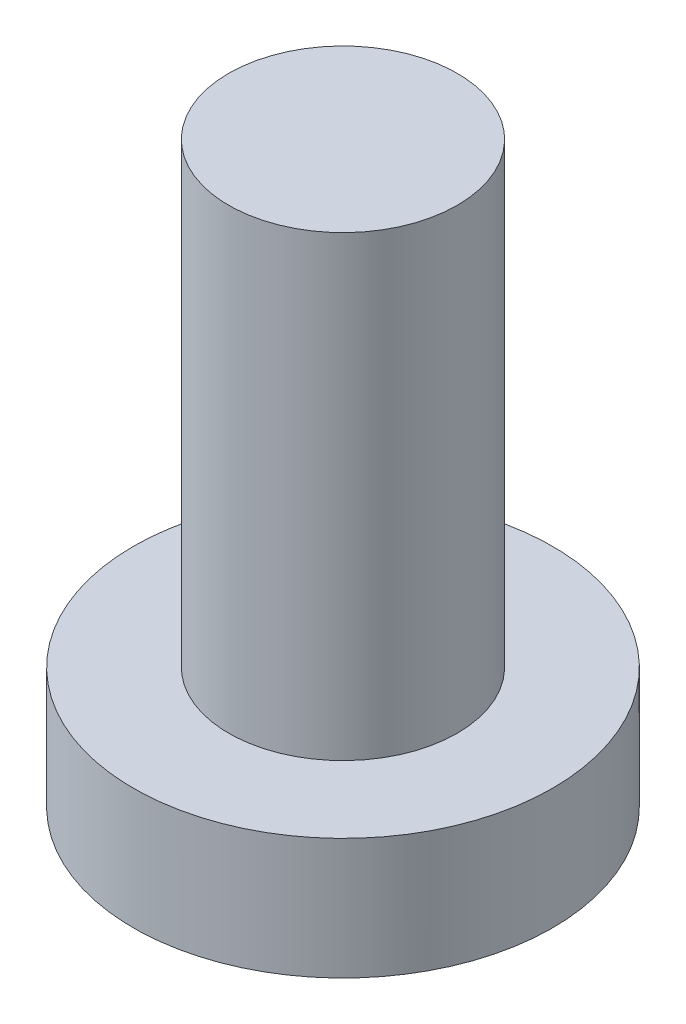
ISO-10303-21;
HEADER;
FILE_DESCRIPTION(('STEP AP214'),'2;1');
FILE_NAME('part.step','',(''),(''),'','','');
FILE_SCHEMA(('AUTOMOTIVE_DESIGN { 1 0 10303 214 1 1 1 1 }'));
ENDSEC;
DATA;
#1=APPLICATION_CONTEXT('core data for automotive mechanical design processes');
#2=APPLICATION_PROTOCOL_DEFINITION('international standard','automotive_design',2000,#1);
#3=PRODUCT_CONTEXT('',#1,'mechanical');
#4=PRODUCT('Part','Part','',(#3));
#5=PRODUCT_RELATED_PRODUCT_CATEGORY('part','',(#4));
#6=PRODUCT_DEFINITION_FORMATION('','',#4);
#7=PRODUCT_DEFINITION_CONTEXT('part definition',#1,'design');
#8=PRODUCT_DEFINITION('design','',#6,#7);
#9=PRODUCT_DEFINITION_SHAPE('','',#8);
#10=(LENGTH_UNIT() NAMED_UNIT(*) SI_UNIT(.MILLI.,.METRE.));
#11=(NAMED_UNIT(*) PLANE_ANGLE_UNIT() SI_UNIT($,.RADIAN.));
#12=(NAMED_UNIT(*) SI_UNIT($,.STERADIAN.) SOLID_ANGLE_UNIT());
#13=UNCERTAINTY_MEASURE_WITH_UNIT(LENGTH_MEASURE(1.E-05),#10,'distance_accuracy_value','');
#14=(GEOMETRIC_REPRESENTATION_CONTEXT(3) GLOBAL_UNCERTAINTY_ASSIGNED_CONTEXT((#13)) GLOBAL_UNIT_ASSIGNED_CONTEXT((#10,
#11,#12)) REPRESENTATION_CONTEXT('',''));
#15=CARTESIAN_POINT('',(0.,0.,0.));
#16=DIRECTION('',(0.,0.,1.));
#17=DIRECTION('',(1.,0.,0.));
#18=AXIS2_PLACEMENT_3D('',#15,#16,#17);
#19=CARTESIAN_POINT('',(9.04741823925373,-41.7373986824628,541.166482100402));
#20=DIRECTION('',(-4.19331020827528E-13,-1.,2.54760156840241E-13));
#21=DIRECTION('',(1.,-4.19331020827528E-13,0.));
#22=AXIS2_PLACEMENT_3D('',#19,#20,#21);
#23=CYLINDRICAL_SURFACE('',#22,0.300000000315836);
#24=DIRECTION('',(1.1719418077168E-13,1.,0.));
#25=VECTOR('',#24,1.);
#26=CARTESIAN_POINT('',(9.28960542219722,-41.7382555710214,541.343528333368));
#27=LINE('',#26,#25);
#28=CARTESIAN_POINT('',(9.2896054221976,-43.2695144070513,541.343528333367));
#29=VERTEX_POINT('',#28);
#30=CARTESIAN_POINT('',(9.28960541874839,-41.878551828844,541.343528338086));
#31=VERTEX_POINT('',#30);
#32=EDGE_CURVE('E227',#29,#31,#27,.T.);
#33=ORIENTED_EDGE('',*,*,#32,.F.);
#34=CARTESIAN_POINT('',(9.2896054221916,-43.2695144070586,541.343528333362));
#35=CARTESIAN_POINT('',(9.30118468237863,-43.2713455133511,541.327738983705));
#36=CARTESIAN_POINT('',(9.31118085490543,-43.2729932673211,541.310770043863));
#37=CARTESIAN_POINT('',(9.32768936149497,-43.2758660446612,541.275230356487));
#38=CARTESIAN_POINT('',(9.33420990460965,-43.2770920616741,541.256663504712));
#39=CARTESIAN_POINT('',(9.34282782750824,-43.2789296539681,541.221384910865));
#40=CARTESIAN_POINT('',(9.34543237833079,-43.2796048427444,541.204798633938));
#41=CARTESIAN_POINT('',(9.34784293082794,-43.2805946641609,541.171420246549));
#42=CARTESIAN_POINT('',(9.34765050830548,-43.2809094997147,541.154628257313));
#43=CARTESIAN_POINT('',(9.34446949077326,-43.281169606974,541.121306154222));
#44=CARTESIAN_POINT('',(9.34148045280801,-43.2811148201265,541.104776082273));
#45=CARTESIAN_POINT('',(9.33278989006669,-43.2806371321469,541.072443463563));
#46=CARTESIAN_POINT('',(9.32708734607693,-43.2802140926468,541.056641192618));
#47=CARTESIAN_POINT('',(9.31314056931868,-43.2790125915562,541.026226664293));
#48=CARTESIAN_POINT('',(9.30489741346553,-43.2782342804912,541.011613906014));
#49=CARTESIAN_POINT('',(9.28610932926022,-43.276344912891,540.983985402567));
#50=CARTESIAN_POINT('',(9.27556643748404,-43.2752341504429,540.970968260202));
#51=CARTESIAN_POINT('',(9.25795338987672,-43.2733098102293,540.952583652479));
#52=CARTESIAN_POINT('',(9.25159531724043,-43.272603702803,540.946507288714));
#53=CARTESIAN_POINT('',(9.23838819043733,-43.2711151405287,540.934949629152));
#54=CARTESIAN_POINT('',(9.23154004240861,-43.2703328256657,540.929467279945));
#55=CARTESIAN_POINT('',(9.22446448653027,-43.2695144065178,540.924294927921));
#56=B_SPLINE_CURVE_WITH_KNOTS('',3,(#34,#35,#36,#37,#38,#39,#40,#41,#42,#43,#44,#45,#46,#47,#48,
#49,#50,#51,#52,#53,#54,#55),.UNSPECIFIED.,.F.,.F.,(4,2,2,2,2,2,2,2,2,2,4),(0.,
0.0589049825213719,0.11767021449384,0.167846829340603,0.217995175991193,0.268151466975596,
0.318326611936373,0.368480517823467,0.418590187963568,0.445029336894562,0.471420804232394),.UNSPECIFIED.);
#57=CARTESIAN_POINT('',(9.22446448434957,-43.2695144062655,540.924294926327));
#58=VERTEX_POINT('',#57);
#59=EDGE_CURVE('E38',#29,#58,#56,.T.);
#60=ORIENTED_EDGE('',*,*,#59,.T.);
#61=DIRECTION('',(2.63164344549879E-13,1.,-3.59990862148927E-13));
#62=VECTOR('',#61,1.);
#63=CARTESIAN_POINT('',(9.22446448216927,-41.7382555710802,540.924294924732));
#64=LINE('',#63,#62);
#65=CARTESIAN_POINT('',(9.22446448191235,-41.8785518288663,540.924294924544));
#66=VERTEX_POINT('',#65);
#67=EDGE_CURVE('E233',#66,#58,#64,.F.);
#68=ORIENTED_EDGE('',*,*,#67,.F.);
#69=CARTESIAN_POINT('',(9.04741823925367,-41.8785518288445,541.166482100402));
#70=DIRECTION('',(-4.19331020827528E-13,-1.,2.54760156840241E-13));
#71=DIRECTION('',(1.,-4.19331020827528E-13,0.));
#72=AXIS2_PLACEMENT_3D('',#69,#70,#71);
#73=CIRCLE('',#72,0.300000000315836);
#74=EDGE_CURVE('E319',#31,#66,#73,.F.);
#75=ORIENTED_EDGE('',*,*,#74,.F.);
#76=EDGE_LOOP('',(#33,#60,#68,#75));
#77=FACE_BOUND('',#76,.T.);
#78=ADVANCED_FACE('F34',(#77),#23,.T.);
#79=CARTESIAN_POINT('',(10.0020017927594,-41.5701304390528,541.983626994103));
#80=DIRECTION('',(0.511088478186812,-0.499999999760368,-0.699134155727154));
#81=DIRECTION('',(-0.8072905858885,0.,-0.590154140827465));
#82=AXIS2_PLACEMENT_3D('',#79,#80,#81);
#83=PLANE('',#82);
#84=DIRECTION('',(0.295077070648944,0.866025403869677,-0.403645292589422));
#85=VECTOR('',#84,1.);
#86=CARTESIAN_POINT('',(9.27443668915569,-43.1063439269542,542.550408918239));
#87=LINE('',#86,#85);
#88=CARTESIAN_POINT('',(9.27443668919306,-43.1063439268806,542.550408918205));
#89=VERTEX_POINT('',#88);
#90=CARTESIAN_POINT('',(9.69277695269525,-41.8785518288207,541.978147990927));
#91=VERTEX_POINT('',#90);
#92=EDGE_CURVE('E212',#89,#91,#87,.T.);
#93=ORIENTED_EDGE('',*,*,#92,.F.);
#94=CARTESIAN_POINT('',(10.9699896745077,-37.3007795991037,539.637942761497));
#95=DIRECTION('',(0.511088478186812,-0.499999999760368,-0.699134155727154));
#96=DIRECTION('',(-0.8072905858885,0.,-0.590154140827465));
#97=AXIS2_PLACEMENT_3D('',#94,#95,#96);
#98=CIRCLE('',#97,6.71281879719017);
#99=CARTESIAN_POINT('',(8.70933327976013,-43.1063439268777,542.137301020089));
#100=VERTEX_POINT('',#99);
#101=EDGE_CURVE('E457',#89,#100,#98,.T.);
#102=ORIENTED_EDGE('',*,*,#101,.T.);
#103=DIRECTION('',(-0.295077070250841,-0.866025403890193,0.403645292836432));
#104=VECTOR('',#103,1.);
#105=CARTESIAN_POINT('',(9.12767354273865,-41.8785518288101,541.565040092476));
#106=LINE('',#105,#104);
#107=CARTESIAN_POINT('',(9.12767354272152,-41.8785518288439,541.565040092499));
#108=VERTEX_POINT('',#107);
#109=EDGE_CURVE('E221',#108,#100,#106,.T.);
#110=ORIENTED_EDGE('',*,*,#109,.F.);
#111=DIRECTION('',(-0.807290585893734,0.,-0.590154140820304));
#112=VECTOR('',#111,1.);
#113=CARTESIAN_POINT('',(9.69277695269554,-41.8785518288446,541.978147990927));
#114=LINE('',#113,#112);
#115=EDGE_CURVE('E164',#91,#108,#114,.T.);
#116=ORIENTED_EDGE('',*,*,#115,.F.);
#117=EDGE_LOOP('',(#93,#102,#110,#116));
#118=FACE_BOUND('',#117,.T.);
#119=ADVANCED_FACE('F271',(#118),#83,.T.);
#120=CARTESIAN_POINT('',(10.0968960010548,-41.7370957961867,541.933682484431));
#121=DIRECTION('',(-7.56376610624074E-13,-1.,1.72474725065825E-13));
#122=DIRECTION('',(1.,-7.56376610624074E-13,0.));
#123=AXIS2_PLACEMENT_3D('',#120,#121,#122);
#124=CYLINDRICAL_SURFACE('',#123,0.299999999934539);
#125=DIRECTION('',(2.49468838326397E-13,1.,-3.41256344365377E-13));
#126=VECTOR('',#125,1.);
#127=CARTESIAN_POINT('',(10.2739422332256,-41.7382555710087,541.691495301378));
#128=LINE('',#127,#126);
#129=CARTESIAN_POINT('',(10.2739422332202,-43.2695144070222,541.691495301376));
#130=VERTEX_POINT('',#129);
#131=CARTESIAN_POINT('',(10.2739422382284,-41.8785518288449,541.691495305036));
#132=VERTEX_POINT('',#131);
#133=EDGE_CURVE('E209',#130,#132,#128,.T.);
#134=ORIENTED_EDGE('',*,*,#133,.F.);
#135=CARTESIAN_POINT('',(10.2739422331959,-43.2695144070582,541.691495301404));
#136=CARTESIAN_POINT('',(10.2604121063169,-43.2710817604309,541.681586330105));
#137=CARTESIAN_POINT('',(10.2460269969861,-43.2725156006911,541.6728294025));
#138=CARTESIAN_POINT('',(10.2159870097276,-43.2750808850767,541.657826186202));
#139=CARTESIAN_POINT('',(10.2003328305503,-43.2762124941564,541.651578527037));
#140=CARTESIAN_POINT('',(10.1681683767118,-43.2781403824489,541.641785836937));
#141=CARTESIAN_POINT('',(10.1516575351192,-43.2789364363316,541.638242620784));
#142=CARTESIAN_POINT('',(10.1182668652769,-43.2801689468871,541.633972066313));
#143=CARTESIAN_POINT('',(10.1013871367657,-43.2806054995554,541.633243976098));
#144=CARTESIAN_POINT('',(10.0678182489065,-43.281105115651,541.634624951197));
#145=CARTESIAN_POINT('',(10.0511285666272,-43.2811699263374,541.636720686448));
#146=CARTESIAN_POINT('',(10.0183323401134,-43.2809288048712,541.64366746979));
#147=CARTESIAN_POINT('',(10.002225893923,-43.2806228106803,541.648518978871));
#148=CARTESIAN_POINT('',(9.97108905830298,-43.2796500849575,541.660822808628));
#149=CARTESIAN_POINT('',(9.95605663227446,-43.2789840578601,541.66827004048));
#150=CARTESIAN_POINT('',(9.92745701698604,-43.2773110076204,541.685551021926));
#151=CARTESIAN_POINT('',(9.91388916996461,-43.276304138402,541.69538369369));
#152=CARTESIAN_POINT('',(9.89254531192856,-43.2743425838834,541.713744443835));
#153=CARTESIAN_POINT('',(9.88428237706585,-43.273469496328,541.721723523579));
#154=CARTESIAN_POINT('',(9.86873947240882,-43.2715894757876,541.738552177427));
#155=CARTESIAN_POINT('',(9.86145811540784,-43.2705827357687,541.747400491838));
#156=CARTESIAN_POINT('',(9.85470882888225,-43.26951440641,541.756636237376));
#157=B_SPLINE_CURVE_WITH_KNOTS('',3,(#135,#136,#137,#138,#139,#140,#141,#142,#143,#144,#145,
#146,#147,#148,#149,#150,#151,#152,#153,#154,#155,#156),.UNSPECIFIED.,.F.,.F.,(4,2,2,2,2,2,2,2,
2,2,4),(0.,0.0504676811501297,0.100907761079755,0.15138165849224,0.201842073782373,
0.252065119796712,0.302296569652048,0.352430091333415,0.402541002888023,0.437028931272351,
0.471467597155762),.UNSPECIFIED.);
#158=CARTESIAN_POINT('',(9.85470882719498,-43.269514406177,541.75663623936));
#159=VERTEX_POINT('',#158);
#160=EDGE_CURVE('E280',#130,#159,#157,.T.);
#161=ORIENTED_EDGE('',*,*,#160,.T.);
#162=DIRECTION('',(1.03653342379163E-13,1.,0.));
#163=VECTOR('',#162,1.);
#164=CARTESIAN_POINT('',(9.85470882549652,-41.7382555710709,541.75663624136));
#165=LINE('',#164,#163);
#166=CARTESIAN_POINT('',(9.85470882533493,-41.8785518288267,541.756636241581));
#167=VERTEX_POINT('',#166);
#168=EDGE_CURVE('E215',#167,#159,#165,.F.);
#169=ORIENTED_EDGE('',*,*,#168,.F.);
#170=CARTESIAN_POINT('',(10.0968960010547,-41.8785518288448,541.933682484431));
#171=DIRECTION('',(-7.56376610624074E-13,-1.,1.72474725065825E-13));
#172=DIRECTION('',(1.,-7.56376610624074E-13,0.));
#173=AXIS2_PLACEMENT_3D('',#170,#171,#172);
#174=CIRCLE('',#173,0.299999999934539);
#175=EDGE_CURVE('E151',#132,#167,#174,.F.);
#176=ORIENTED_EDGE('',*,*,#175,.F.);
#177=EDGE_LOOP('',(#134,#161,#169,#176));
#178=FACE_BOUND('',#177,.T.);
#179=ADVANCED_FACE('F270',(#178),#124,.T.);
#180=CARTESIAN_POINT('',(10.9143176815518,-41.5707242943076,540.9793012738));
#181=DIRECTION('',(-0.699134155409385,-0.500000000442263,-0.511088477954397));
#182=DIRECTION('',(-0.590154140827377,0.,0.807290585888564));
#183=AXIS2_PLACEMENT_3D('',#180,#181,#182);
#184=PLANE('',#183);
#185=CARTESIAN_POINT('',(11.277954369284,-43.114251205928,541.991909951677));
#186=CARTESIAN_POINT('',(11.1746071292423,-43.1142511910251,542.133281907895));
#187=CARTESIAN_POINT('',(11.0677149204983,-43.1063439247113,542.271767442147));
#188=B_SPLINE_CURVE_WITH_KNOTS('',2,(#185,#186,#187),.UNSPECIFIED.,.F.,.F.,(3,3),(0.,1.),.UNSPECIFIED.);
#189=CARTESIAN_POINT('',(11.2779543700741,-43.1142512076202,541.991909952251));
#190=VERTEX_POINT('',#189);
#191=CARTESIAN_POINT('',(11.0677149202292,-43.106343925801,542.271767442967));
#192=VERTEX_POINT('',#191);
#193=EDGE_CURVE('E274',#190,#192,#188,.T.);
#194=ORIENTED_EDGE('',*,*,#193,.T.);
#195=DIRECTION('',(0.40364529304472,-0.866025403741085,0.295077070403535));
#196=VECTOR('',#195,1.);
#197=CARTESIAN_POINT('',(10.4954539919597,-41.8785518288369,541.853427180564));
#198=LINE('',#197,#196);
#199=CARTESIAN_POINT('',(10.495453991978,-41.878551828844,541.853427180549));
#200=VERTEX_POINT('',#199);
#201=EDGE_CURVE('E179',#200,#192,#198,.T.);
#202=ORIENTED_EDGE('',*,*,#201,.F.);
#203=DIRECTION('',(-0.590154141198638,0.,0.807290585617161));
#204=VECTOR('',#203,1.);
#205=CARTESIAN_POINT('',(10.9085618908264,-41.8785518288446,541.288323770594));
#206=LINE('',#205,#204);
#207=CARTESIAN_POINT('',(10.9085618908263,-41.878551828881,541.288323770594));
#208=VERTEX_POINT('',#207);
#209=EDGE_CURVE('E171',#208,#200,#206,.T.);
#210=ORIENTED_EDGE('',*,*,#209,.F.);
#211=DIRECTION('',(-0.403645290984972,0.866025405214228,-0.295077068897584));
#212=VECTOR('',#211,1.);
#213=CARTESIAN_POINT('',(11.4808228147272,-43.1063439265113,541.70666403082));
#214=LINE('',#213,#212);
#215=CARTESIAN_POINT('',(11.4808228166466,-43.1063439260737,541.706664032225));
#216=VERTEX_POINT('',#215);
#217=EDGE_CURVE('E176',#216,#208,#214,.T.);
#218=ORIENTED_EDGE('',*,*,#217,.F.);
#219=CARTESIAN_POINT('',(11.4808228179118,-43.1063439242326,541.706664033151));
#220=CARTESIAN_POINT('',(11.3813015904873,-43.1142511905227,541.850537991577));
#221=CARTESIAN_POINT('',(11.277954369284,-43.114251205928,541.991909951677));
#222=B_SPLINE_CURVE_WITH_KNOTS('',2,(#219,#220,#221),.UNSPECIFIED.,.F.,.F.,(3,3),(0.,1.),.UNSPECIFIED.);
#223=EDGE_CURVE('E277',#216,#190,#222,.T.);
#224=ORIENTED_EDGE('',*,*,#223,.T.);
#225=EDGE_LOOP('',(#194,#202,#210,#218,#224));
#226=FACE_BOUND('',#225,.T.);
#227=ADVANCED_FACE('F173',(#226),#184,.T.);
#228=CARTESIAN_POINT('',(10.8640963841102,-41.7370957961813,540.884204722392));
#229=DIRECTION('',(-3.9137561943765E-13,-1.,2.37776146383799E-13));
#230=DIRECTION('',(1.,-3.9137561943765E-13,0.));
#231=AXIS2_PLACEMENT_3D('',#228,#229,#230);
#232=CYLINDRICAL_SURFACE('',#231,0.300000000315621);
#233=DIRECTION('',(1.0365334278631E-13,1.,0.));
#234=VECTOR('',#233,1.);
#235=CARTESIAN_POINT('',(10.6219092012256,-41.7382555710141,540.707158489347));
#236=LINE('',#235,#234);
#237=CARTESIAN_POINT('',(10.621909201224,-43.2695144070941,540.707158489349));
#238=VERTEX_POINT('',#237);
#239=CARTESIAN_POINT('',(10.6219092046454,-41.8785518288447,540.707158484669));
#240=VERTEX_POINT('',#239);
#241=EDGE_CURVE('E195',#238,#240,#236,.T.);
#242=ORIENTED_EDGE('',*,*,#241,.F.);
#243=CARTESIAN_POINT('',(10.6219092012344,-43.2695144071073,540.707158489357));
#244=CARTESIAN_POINT('',(10.6120002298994,-43.271081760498,540.720688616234));
#245=CARTESIAN_POINT('',(10.6032433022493,-43.2725156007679,540.735073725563));
#246=CARTESIAN_POINT('',(10.5882400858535,-43.2750808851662,540.765113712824));
#247=CARTESIAN_POINT('',(10.5819924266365,-43.2762124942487,540.780767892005));
#248=CARTESIAN_POINT('',(10.5721997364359,-43.2781403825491,540.812932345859));
#249=CARTESIAN_POINT('',(10.568656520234,-43.278936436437,540.829443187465));
#250=CARTESIAN_POINT('',(10.5643859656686,-43.2801689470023,540.86283385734));
#251=CARTESIAN_POINT('',(10.5636578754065,-43.2806054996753,540.879713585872));
#252=CARTESIAN_POINT('',(10.5650388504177,-43.2811051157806,540.913282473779));
#253=CARTESIAN_POINT('',(10.5671345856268,-43.2811699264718,540.929972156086));
#254=CARTESIAN_POINT('',(10.5740813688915,-43.2809288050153,540.962768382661));
#255=CARTESIAN_POINT('',(10.5789328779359,-43.2806228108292,540.978874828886));
#256=CARTESIAN_POINT('',(10.5912367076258,-43.2796500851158,541.010011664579));
#257=CARTESIAN_POINT('',(10.5986839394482,-43.278984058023,541.025044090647));
#258=CARTESIAN_POINT('',(10.6159649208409,-43.2773110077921,541.053643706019));
#259=CARTESIAN_POINT('',(10.6257975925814,-43.276304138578,541.067211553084));
#260=CARTESIAN_POINT('',(10.6441583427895,-43.2743425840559,541.088555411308));
#261=CARTESIAN_POINT('',(10.652137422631,-43.273469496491,541.096818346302));
#262=CARTESIAN_POINT('',(10.6689660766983,-43.2715894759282,541.112361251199));
#263=CARTESIAN_POINT('',(10.6778143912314,-43.2705827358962,541.119642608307));
#264=CARTESIAN_POINT('',(10.6870501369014,-43.269514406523,541.126391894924));
#265=B_SPLINE_CURVE_WITH_KNOTS('',3,(#243,#244,#245,#246,#247,#248,#249,#250,#251,#252,#253,
#254,#255,#256,#257,#258,#259,#260,#261,#262,#263,#264),.UNSPECIFIED.,.F.,.F.,(4,2,2,2,2,2,2,2,
2,2,4),(0.,0.0504676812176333,0.100907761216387,0.151381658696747,0.201842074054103,
0.252065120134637,0.302296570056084,0.352430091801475,0.40254100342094,0.437028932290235,
0.47146759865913),.UNSPECIFIED.);
#266=CARTESIAN_POINT('',(10.6870501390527,-43.2695144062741,541.126391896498));
#267=VERTEX_POINT('',#266);
#268=EDGE_CURVE('E340',#238,#267,#265,.T.);
#269=ORIENTED_EDGE('',*,*,#268,.T.);
#270=DIRECTION('',(2.63164344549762E-13,1.,-3.59990862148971E-13));
#271=VECTOR('',#270,1.);
#272=CARTESIAN_POINT('',(10.687050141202,-41.7382555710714,541.126391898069));
#273=LINE('',#272,#271);
#274=CARTESIAN_POINT('',(10.687050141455,-41.8785518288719,541.126391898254));
#275=VERTEX_POINT('',#274);
#276=EDGE_CURVE('E190',#275,#267,#273,.F.);
#277=ORIENTED_EDGE('',*,*,#276,.F.);
#278=CARTESIAN_POINT('',(10.8640963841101,-41.8785518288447,540.884204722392));
#279=DIRECTION('',(-3.9137561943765E-13,-1.,2.37776146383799E-13));
#280=DIRECTION('',(1.,-3.9137561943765E-13,0.));
#281=AXIS2_PLACEMENT_3D('',#278,#279,#280);
#282=CIRCLE('',#281,0.300000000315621);
#283=EDGE_CURVE('E186',#240,#275,#282,.F.);
#284=ORIENTED_EDGE('',*,*,#283,.F.);
#285=EDGE_LOOP('',(#242,#269,#277,#284));
#286=FACE_BOUND('',#285,.T.);
#287=ADVANCED_FACE('F265',(#286),#232,.T.);
#288=CARTESIAN_POINT('',(11.5154502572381,-43.4266343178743,539.913332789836));
#289=DIRECTION('',(-0.51108847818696,-0.499999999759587,0.699134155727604));
#290=DIRECTION('',(0.807290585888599,0.,0.590154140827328));
#291=AXIS2_PLACEMENT_3D('',#288,#289,#290);
#292=PLANE('',#291);
#293=DIRECTION('',(-0.295077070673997,0.866025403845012,0.403645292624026));
#294=VECTOR('',#293,1.);
#295=CARTESIAN_POINT('',(10.6370779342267,-43.1063439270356,539.50027790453));
#296=LINE('',#295,#294);
#297=CARTESIAN_POINT('',(10.6370779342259,-43.1063439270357,539.50027790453));
#298=VERTEX_POINT('',#297);
#299=CARTESIAN_POINT('',(10.2187376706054,-41.8785518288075,540.072538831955));
#300=VERTEX_POINT('',#299);
#301=EDGE_CURVE('E408',#298,#300,#296,.T.);
#302=ORIENTED_EDGE('',*,*,#301,.F.);
#303=CARTESIAN_POINT('',(8.94152494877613,-37.3007795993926,542.412744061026));
#304=DIRECTION('',(-0.51108847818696,-0.499999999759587,0.699134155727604));
#305=DIRECTION('',(0.807290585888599,0.,0.590154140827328));
#306=AXIS2_PLACEMENT_3D('',#303,#304,#305);
#307=CIRCLE('',#306,6.71281879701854);
#308=CARTESIAN_POINT('',(11.2021813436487,-43.1063439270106,539.913385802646));
#309=VERTEX_POINT('',#308);
#310=EDGE_CURVE('E328',#298,#309,#307,.T.);
#311=ORIENTED_EDGE('',*,*,#310,.T.);
#312=DIRECTION('',(0.29507707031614,-0.866025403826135,-0.403645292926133));
#313=VECTOR('',#312,1.);
#314=CARTESIAN_POINT('',(10.7838410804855,-41.878551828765,540.485646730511));
#315=LINE('',#314,#313);
#316=CARTESIAN_POINT('',(10.7838410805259,-41.8785518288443,540.485646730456));
#317=VERTEX_POINT('',#316);
#318=EDGE_CURVE('E290',#317,#309,#315,.T.);
#319=ORIENTED_EDGE('',*,*,#318,.F.);
#320=DIRECTION('',(0.807290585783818,0.,0.590154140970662));
#321=VECTOR('',#320,1.);
#322=CARTESIAN_POINT('',(10.2187376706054,-41.8785518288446,540.072538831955));
#323=LINE('',#322,#321);
#324=EDGE_CURVE('E293',#300,#317,#323,.T.);
#325=ORIENTED_EDGE('',*,*,#324,.F.);
#326=EDGE_LOOP('',(#302,#311,#319,#325));
#327=FACE_BOUND('',#326,.T.);
#328=ADVANCED_FACE('F262',(#327),#292,.T.);
#329=CARTESIAN_POINT('',(9.81461862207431,-41.7370957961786,540.117004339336));
#330=DIRECTION('',(-7.3390690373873E-13,-1.,1.77960420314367E-13));
#331=DIRECTION('',(1.,-7.3390690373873E-13,0.));
#332=AXIS2_PLACEMENT_3D('',#329,#330,#331);
#333=CYLINDRICAL_SURFACE('',#332,0.300000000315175);
#334=DIRECTION('',(2.63164344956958E-13,1.,-3.59990861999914E-13));
#335=VECTOR('',#334,1.);
#336=CARTESIAN_POINT('',(9.63757238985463,-41.7382555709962,540.359191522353));
#337=LINE('',#336,#335);
#338=CARTESIAN_POINT('',(9.63757238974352,-43.2695144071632,540.359191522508));
#339=VERTEX_POINT('',#338);
#340=CARTESIAN_POINT('',(9.63757238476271,-41.8785518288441,540.359191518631));
#341=VERTEX_POINT('',#340);
#342=EDGE_CURVE('E309',#339,#341,#337,.T.);
#343=ORIENTED_EDGE('',*,*,#342,.F.);
#344=CARTESIAN_POINT('',(9.63757238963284,-43.269514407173,540.359191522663));
#345=CARTESIAN_POINT('',(9.6511025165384,-43.2710817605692,540.369100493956));
#346=CARTESIAN_POINT('',(9.66548762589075,-43.2725156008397,540.377857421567));
#347=CARTESIAN_POINT('',(9.69552761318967,-43.2750808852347,540.392860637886));
#348=CARTESIAN_POINT('',(9.71118179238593,-43.2762124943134,540.399108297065));
#349=CARTESIAN_POINT('',(9.74334624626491,-43.2781403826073,540.408900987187));
#350=CARTESIAN_POINT('',(9.75985708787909,-43.2789364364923,540.412444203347));
#351=CARTESIAN_POINT('',(9.7932477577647,-43.2801689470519,540.41671475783));
#352=CARTESIAN_POINT('',(9.81012748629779,-43.2806054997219,540.41744284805));
#353=CARTESIAN_POINT('',(9.84369637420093,-43.2811051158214,540.416061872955));
#354=CARTESIAN_POINT('',(9.86038605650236,-43.2811699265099,540.413966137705));
#355=CARTESIAN_POINT('',(9.89318228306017,-43.280928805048,540.407019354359));
#356=CARTESIAN_POINT('',(9.90928872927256,-43.2806228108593,540.402167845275));
#357=CARTESIAN_POINT('',(9.9404255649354,-43.279650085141,540.389864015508));
#358=CARTESIAN_POINT('',(9.95545799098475,-43.2789840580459,540.382416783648));
#359=CARTESIAN_POINT('',(9.98405760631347,-43.2773110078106,540.365135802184));
#360=CARTESIAN_POINT('',(9.99762545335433,-43.2763041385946,540.35530313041));
#361=CARTESIAN_POINT('',(10.0189693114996,-43.2743425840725,540.336942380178));
#362=CARTESIAN_POINT('',(10.0272322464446,-43.2734694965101,540.328963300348));
#363=CARTESIAN_POINT('',(10.0427751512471,-43.2715894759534,540.312134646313));
#364=CARTESIAN_POINT('',(10.0500565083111,-43.2705827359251,540.303286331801));
#365=CARTESIAN_POINT('',(10.0568057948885,-43.269514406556,540.294050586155));
#366=B_SPLINE_CURVE_WITH_KNOTS('',3,(#344,#345,#346,#347,#348,#349,#350,#351,#352,#353,#354,
#355,#356,#357,#358,#359,#360,#361,#362,#363,#364,#365),.UNSPECIFIED.,.F.,.F.,(4,2,2,2,2,2,2,2,
2,2,4),(0.,0.0504676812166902,0.100907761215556,0.151381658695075,0.201842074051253,
0.252065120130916,0.302296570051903,0.352430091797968,0.402541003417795,0.437028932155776,
0.471467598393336),.UNSPECIFIED.);
#367=CARTESIAN_POINT('',(10.0568057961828,-43.2695144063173,540.294050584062));
#368=VERTEX_POINT('',#367);
#369=EDGE_CURVE('E58',#339,#368,#366,.T.);
#370=ORIENTED_EDGE('',*,*,#369,.T.);
#371=DIRECTION('',(1.03653342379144E-13,1.,0.));
#372=VECTOR('',#371,1.);
#373=CARTESIAN_POINT('',(10.0568057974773,-41.73825557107,540.294050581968));
#374=LINE('',#373,#372);
#375=CARTESIAN_POINT('',(10.0568057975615,-41.8785518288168,540.294050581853));
#376=VERTEX_POINT('',#375);
#377=EDGE_CURVE('E302',#376,#368,#374,.F.);
#378=ORIENTED_EDGE('',*,*,#377,.F.);
#379=CARTESIAN_POINT('',(9.8146186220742,-41.8785518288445,540.117004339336));
#380=DIRECTION('',(-7.3390690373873E-13,-1.,1.77960420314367E-13));
#381=DIRECTION('',(1.,-7.3390690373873E-13,0.));
#382=AXIS2_PLACEMENT_3D('',#379,#380,#381);
#383=CIRCLE('',#382,0.300000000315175);
#384=EDGE_CURVE('E296',#341,#376,#383,.F.);
#385=ORIENTED_EDGE('',*,*,#384,.F.);
#386=EDGE_LOOP('',(#343,#370,#378,#385));
#387=FACE_BOUND('',#386,.T.);
#388=ADVANCED_FACE('F261',(#387),#333,.T.);
#389=CARTESIAN_POINT('',(11.3901566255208,-41.8785518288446,540.15388917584));
#390=DIRECTION('',(0.,-1.,0.));
#391=DIRECTION('',(0.,0.,-1.));
#392=AXIS2_PLACEMENT_3D('',#389,#390,#391);
#393=PLANE('',#392);
#394=ORIENTED_EDGE('',*,*,#283,.T.);
#395=DIRECTION('',(0.807290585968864,0.,0.590154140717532));
#396=VECTOR('',#395,1.);
#397=CARTESIAN_POINT('',(12.0458396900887,-41.8785518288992,542.11970866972));
#398=LINE('',#397,#396);
#399=EDGE_CURVE('E183',#208,#275,#398,.F.);
#400=ORIENTED_EDGE('',*,*,#399,.F.);
#401=ORIENTED_EDGE('',*,*,#209,.T.);
#402=DIRECTION('',(-0.807290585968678,0.,-0.590154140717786));
#403=VECTOR('',#402,1.);
#404=CARTESIAN_POINT('',(9.70892535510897,-41.8785518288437,541.278450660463));
#405=LINE('',#404,#403);
#406=EDGE_CURVE('E206',#132,#200,#405,.F.);
#407=ORIENTED_EDGE('',*,*,#406,.F.);
#408=ORIENTED_EDGE('',*,*,#175,.T.);
#409=DIRECTION('',(-0.590154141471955,0.,0.807290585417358));
#410=VECTOR('',#409,1.);
#411=CARTESIAN_POINT('',(8.86139204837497,-41.8785518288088,543.115425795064));
#412=LINE('',#411,#410);
#413=EDGE_CURVE('E220',#91,#167,#412,.F.);
#414=ORIENTED_EDGE('',*,*,#413,.F.);
#415=ORIENTED_EDGE('',*,*,#115,.T.);
#416=DIRECTION('',(0.590154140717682,0.,-0.807290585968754));
#417=VECTOR('',#416,1.);
#418=CARTESIAN_POINT('',(9.70265006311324,-41.8785518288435,540.778511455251));
#419=LINE('',#418,#417);
#420=EDGE_CURVE('E224',#31,#108,#419,.F.);
#421=ORIENTED_EDGE('',*,*,#420,.F.);
#422=ORIENTED_EDGE('',*,*,#74,.T.);
#423=DIRECTION('',(-0.807290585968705,0.,-0.590154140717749));
#424=VECTOR('',#423,1.);
#425=CARTESIAN_POINT('',(7.86567492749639,-41.8785518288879,539.93097814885));
#426=LINE('',#425,#424);
#427=CARTESIAN_POINT('',(9.00295273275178,-41.8785518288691,540.762363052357));
#428=VERTEX_POINT('',#427);
#429=EDGE_CURVE('E237',#428,#66,#426,.F.);
#430=ORIENTED_EDGE('',*,*,#429,.F.);
#431=DIRECTION('',(0.590154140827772,0.,-0.807290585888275));
#432=VECTOR('',#431,1.);
#433=CARTESIAN_POINT('',(9.56529158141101,-41.8785518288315,539.993121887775));
#434=LINE('',#433,#432);
#435=CARTESIAN_POINT('',(9.41606063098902,-41.8785518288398,540.197259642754));
#436=VERTEX_POINT('',#435);
#437=EDGE_CURVE('E242',#436,#428,#434,.F.);
#438=ORIENTED_EDGE('',*,*,#437,.F.);
#439=DIRECTION('',(0.807290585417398,0.,0.5901541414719));
#440=VECTOR('',#439,1.);
#441=CARTESIAN_POINT('',(10.2025892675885,-41.8785518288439,540.772236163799));
#442=LINE('',#441,#440);
#443=EDGE_CURVE('E305',#341,#436,#442,.F.);
#444=ORIENTED_EDGE('',*,*,#443,.F.);
#445=ORIENTED_EDGE('',*,*,#384,.T.);
#446=DIRECTION('',(0.59015414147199,0.,-0.807290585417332));
#447=VECTOR('',#446,1.);
#448=CARTESIAN_POINT('',(11.0501225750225,-41.8785518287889,538.935261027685));
#449=LINE('',#448,#447);
#450=EDGE_CURVE('E299',#300,#376,#449,.F.);
#451=ORIENTED_EDGE('',*,*,#450,.F.);
#452=ORIENTED_EDGE('',*,*,#324,.T.);
#453=DIRECTION('',(-0.590154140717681,0.,0.807290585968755));
#454=VECTOR('',#453,1.);
#455=CARTESIAN_POINT('',(10.2088645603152,-41.8785518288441,541.272175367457));
#456=LINE('',#455,#454);
#457=EDGE_CURVE('E198',#240,#317,#456,.F.);
#458=ORIENTED_EDGE('',*,*,#457,.F.);
#459=EDGE_LOOP('',(#394,#400,#401,#407,#408,#414,#415,#421,#422,#430,#438,#444,#445,#451,#452,#458));
#460=FACE_BOUND('',#459,.T.);
#461=ADVANCED_FACE('F184',(#460),#393,.T.);
#462=CARTESIAN_POINT('',(8.84679136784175,-43.4201019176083,539.467876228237));
#463=DIRECTION('',(0.699134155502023,-0.500000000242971,0.511088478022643));
#464=DIRECTION('',(0.590154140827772,0.,-0.807290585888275));
#465=AXIS2_PLACEMENT_3D('',#462,#463,#464);
#466=PLANE('',#465);
#467=CARTESIAN_POINT('',(8.63356025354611,-43.1142512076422,540.058776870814));
#468=CARTESIAN_POINT('',(8.73690754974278,-43.1142511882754,539.917404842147));
#469=CARTESIAN_POINT('',(8.84379970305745,-43.1063439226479,539.778919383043));
#470=B_SPLINE_CURVE_WITH_KNOTS('',2,(#467,#468,#469),.UNSPECIFIED.,.F.,.F.,(3,3),(0.,1.),.UNSPECIFIED.);
#471=CARTESIAN_POINT('',(8.63356025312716,-43.1142512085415,540.058776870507));
#472=VERTEX_POINT('',#471);
#473=CARTESIAN_POINT('',(8.84379970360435,-43.1063439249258,539.778919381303));
#474=VERTEX_POINT('',#473);
#475=EDGE_CURVE('E241',#472,#474,#470,.T.);
#476=ORIENTED_EDGE('',*,*,#475,.T.);
#477=DIRECTION('',(-0.403645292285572,-0.86602540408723,-0.295077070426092));
#478=VECTOR('',#477,1.);
#479=CARTESIAN_POINT('',(9.4160606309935,-41.8785518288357,540.197259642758));
#480=LINE('',#479,#478);
#481=EDGE_CURVE('E308',#436,#474,#480,.T.);
#482=ORIENTED_EDGE('',*,*,#481,.F.);
#483=ORIENTED_EDGE('',*,*,#437,.T.);
#484=DIRECTION('',(0.403645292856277,0.866025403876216,0.295077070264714));
#485=VECTOR('',#484,1.);
#486=CARTESIAN_POINT('',(8.43069180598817,-43.1063439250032,540.344022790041));
#487=LINE('',#486,#485);
#488=CARTESIAN_POINT('',(8.43069180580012,-43.1063439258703,540.344022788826));
#489=VERTEX_POINT('',#488);
#490=EDGE_CURVE('E230',#489,#428,#487,.T.);
#491=ORIENTED_EDGE('',*,*,#490,.F.);
#492=CARTESIAN_POINT('',(8.43069180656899,-43.1063439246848,540.344022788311));
#493=CARTESIAN_POINT('',(8.5302130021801,-43.1142511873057,540.200148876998));
#494=CARTESIAN_POINT('',(8.63356025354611,-43.1142512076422,540.058776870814));
#495=B_SPLINE_CURVE_WITH_KNOTS('',2,(#492,#493,#494),.UNSPECIFIED.,.F.,.F.,(3,3),(0.,1.),.UNSPECIFIED.);
#496=EDGE_CURVE('E114',#489,#472,#495,.T.);
#497=ORIENTED_EDGE('',*,*,#496,.T.);
#498=EDGE_LOOP('',(#476,#482,#483,#491,#497));
#499=FACE_BOUND('',#498,.T.);
#500=ADVANCED_FACE('F245',(#499),#466,.T.);
#501=CARTESIAN_POINT('',(7.86567492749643,-41.7382555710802,539.93097814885));
#502=DIRECTION('',(0.590154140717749,-4.4592476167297E-13,-0.807290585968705));
#503=DIRECTION('',(-0.807290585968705,0.,-0.590154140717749));
#504=AXIS2_PLACEMENT_3D('',#501,#502,#503);
#505=PLANE('',#504);
#506=CARTESIAN_POINT('',(9.74920336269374,-36.3085518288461,541.307895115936));
#507=DIRECTION('',(0.590154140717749,-4.4592476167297E-13,-0.807290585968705));
#508=DIRECTION('',(-0.807290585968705,0.,-0.590154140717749));
#509=AXIS2_PLACEMENT_3D('',#506,#507,#508);
#510=CIRCLE('',#509,6.99124452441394);
#511=EDGE_CURVE('E316',#489,#58,#510,.F.);
#512=ORIENTED_EDGE('',*,*,#511,.F.);
#513=ORIENTED_EDGE('',*,*,#490,.T.);
#514=ORIENTED_EDGE('',*,*,#429,.T.);
#515=ORIENTED_EDGE('',*,*,#67,.T.);
#516=EDGE_LOOP('',(#512,#513,#514,#515));
#517=FACE_BOUND('',#516,.T.);
#518=ADVANCED_FACE('F255',(#517),#505,.T.);
#519=CARTESIAN_POINT('',(9.70265006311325,-41.7382555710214,540.778511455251));
#520=DIRECTION('',(0.807290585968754,-1.45169760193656E-13,0.590154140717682));
#521=DIRECTION('',(0.590154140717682,0.,-0.807290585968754));
#522=AXIS2_PLACEMENT_3D('',#519,#520,#521);
#523=PLANE('',#522);
#524=ORIENTED_EDGE('',*,*,#420,.T.);
#525=ORIENTED_EDGE('',*,*,#109,.T.);
#526=CARTESIAN_POINT('',(9.67320560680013,-36.3085518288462,540.818789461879));
#527=DIRECTION('',(0.807290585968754,-1.45169760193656E-13,0.590154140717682));
#528=DIRECTION('',(0.590154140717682,0.,-0.807290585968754));
#529=AXIS2_PLACEMENT_3D('',#526,#527,#528);
#530=CIRCLE('',#529,6.99124452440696);
#531=EDGE_CURVE('E395',#29,#100,#530,.F.);
#532=ORIENTED_EDGE('',*,*,#531,.F.);
#533=ORIENTED_EDGE('',*,*,#32,.T.);
#534=EDGE_LOOP('',(#524,#525,#532,#533));
#535=FACE_BOUND('',#534,.T.);
#536=ADVANCED_FACE('F462',(#535),#523,.T.);
#537=CARTESIAN_POINT('',(8.86139204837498,-41.7382555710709,543.115425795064));
#538=DIRECTION('',(-0.807290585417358,1.28396570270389E-13,-0.590154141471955));
#539=DIRECTION('',(-0.590154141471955,0.,0.807290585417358));
#540=AXIS2_PLACEMENT_3D('',#537,#538,#539);
#541=PLANE('',#540);
#542=CARTESIAN_POINT('',(10.2383090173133,-36.3085518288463,541.231897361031));
#543=DIRECTION('',(-0.807290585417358,1.28396570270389E-13,-0.590154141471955));
#544=DIRECTION('',(-0.590154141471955,0.,0.807290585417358));
#545=AXIS2_PLACEMENT_3D('',#542,#543,#544);
#546=CIRCLE('',#545,6.99124452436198);
#547=EDGE_CURVE('E393',#89,#159,#546,.F.);
#548=ORIENTED_EDGE('',*,*,#547,.F.);
#549=ORIENTED_EDGE('',*,*,#92,.T.);
#550=ORIENTED_EDGE('',*,*,#413,.T.);
#551=ORIENTED_EDGE('',*,*,#168,.T.);
#552=EDGE_LOOP('',(#548,#549,#550,#551));
#553=FACE_BOUND('',#552,.T.);
#554=ADVANCED_FACE('F460',(#553),#541,.T.);
#555=CARTESIAN_POINT('',(9.708925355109,-41.7382555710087,541.278450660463));
#556=DIRECTION('',(0.590154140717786,-4.22718102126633E-13,-0.807290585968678));
#557=DIRECTION('',(-0.807290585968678,0.,-0.590154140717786));
#558=AXIS2_PLACEMENT_3D('',#555,#556,#557);
#559=PLANE('',#558);
#560=ORIENTED_EDGE('',*,*,#406,.T.);
#561=ORIENTED_EDGE('',*,*,#201,.T.);
#562=CARTESIAN_POINT('',(9.74920336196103,-36.3085518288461,541.307895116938));
#563=DIRECTION('',(0.590154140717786,-4.22718102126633E-13,-0.807290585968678));
#564=DIRECTION('',(-0.807290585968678,0.,-0.590154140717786));
#565=AXIS2_PLACEMENT_3D('',#562,#563,#564);
#566=CIRCLE('',#565,6.99124452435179);
#567=EDGE_CURVE('E390',#130,#192,#566,.F.);
#568=ORIENTED_EDGE('',*,*,#567,.F.);
#569=ORIENTED_EDGE('',*,*,#133,.T.);
#570=EDGE_LOOP('',(#560,#561,#568,#569));
#571=FACE_BOUND('',#570,.T.);
#572=ADVANCED_FACE('F455',(#571),#559,.T.);
#573=CARTESIAN_POINT('',(12.0458396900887,-41.7382555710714,542.11970866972));
#574=DIRECTION('',(-0.590154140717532,4.45924761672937E-13,0.807290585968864));
#575=DIRECTION('',(0.807290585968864,0.,0.590154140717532));
#576=AXIS2_PLACEMENT_3D('',#573,#574,#575);
#577=PLANE('',#576);
#578=CARTESIAN_POINT('',(10.1623112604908,-36.3085518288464,540.742791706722));
#579=DIRECTION('',(-0.590154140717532,4.45924761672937E-13,0.807290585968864));
#580=DIRECTION('',(0.807290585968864,0.,0.590154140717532));
#581=AXIS2_PLACEMENT_3D('',#578,#579,#580);
#582=CIRCLE('',#581,6.99124452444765);
#583=EDGE_CURVE('E194',#216,#267,#582,.F.);
#584=ORIENTED_EDGE('',*,*,#583,.F.);
#585=ORIENTED_EDGE('',*,*,#217,.T.);
#586=ORIENTED_EDGE('',*,*,#399,.T.);
#587=ORIENTED_EDGE('',*,*,#276,.T.);
#588=EDGE_LOOP('',(#584,#585,#586,#587));
#589=FACE_BOUND('',#588,.T.);
#590=ADVANCED_FACE('F192',(#589),#577,.T.);
#591=CARTESIAN_POINT('',(10.2088645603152,-41.7382555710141,541.272175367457));
#592=DIRECTION('',(-0.807290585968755,1.28396570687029E-13,-0.590154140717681));
#593=DIRECTION('',(-0.590154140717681,0.,0.807290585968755));
#594=AXIS2_PLACEMENT_3D('',#591,#592,#593);
#595=PLANE('',#594);
#596=ORIENTED_EDGE('',*,*,#457,.T.);
#597=ORIENTED_EDGE('',*,*,#318,.T.);
#598=CARTESIAN_POINT('',(10.2383090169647,-36.3085518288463,541.231897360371));
#599=DIRECTION('',(-0.807290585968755,1.28396570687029E-13,-0.590154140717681));
#600=DIRECTION('',(-0.590154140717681,0.,0.807290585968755));
#601=AXIS2_PLACEMENT_3D('',#598,#599,#600);
#602=CIRCLE('',#601,6.99124452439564);
#603=EDGE_CURVE('E386',#238,#309,#602,.F.);
#604=ORIENTED_EDGE('',*,*,#603,.F.);
#605=ORIENTED_EDGE('',*,*,#241,.T.);
#606=EDGE_LOOP('',(#596,#597,#604,#605));
#607=FACE_BOUND('',#606,.T.);
#608=ADVANCED_FACE('F420',(#607),#595,.T.);
#609=CARTESIAN_POINT('',(11.0501225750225,-41.73825557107,538.935261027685));
#610=DIRECTION('',(0.807290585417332,-1.28396570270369E-13,0.59015414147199));
#611=DIRECTION('',(0.59015414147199,0.,-0.807290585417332));
#612=AXIS2_PLACEMENT_3D('',#609,#610,#611);
#613=PLANE('',#612);
#614=CARTESIAN_POINT('',(9.67320560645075,-36.3085518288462,540.818789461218));
#615=DIRECTION('',(0.807290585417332,-1.28396570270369E-13,0.59015414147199));
#616=DIRECTION('',(0.59015414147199,0.,-0.807290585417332));
#617=AXIS2_PLACEMENT_3D('',#614,#615,#616);
#618=CIRCLE('',#617,6.9912445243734);
#619=EDGE_CURVE('E384',#298,#368,#618,.F.);
#620=ORIENTED_EDGE('',*,*,#619,.F.);
#621=ORIENTED_EDGE('',*,*,#301,.T.);
#622=ORIENTED_EDGE('',*,*,#450,.T.);
#623=ORIENTED_EDGE('',*,*,#377,.T.);
#624=EDGE_LOOP('',(#620,#621,#622,#623));
#625=FACE_BOUND('',#624,.T.);
#626=ADVANCED_FACE('F466',(#625),#613,.T.);
#627=CARTESIAN_POINT('',(10.2025892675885,-41.7382555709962,540.772236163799));
#628=DIRECTION('',(-0.5901541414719,4.45924761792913E-13,0.807290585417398));
#629=DIRECTION('',(0.807290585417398,0.,0.5901541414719));
#630=AXIS2_PLACEMENT_3D('',#627,#628,#629);
#631=PLANE('',#630);
#632=ORIENTED_EDGE('',*,*,#443,.T.);
#633=ORIENTED_EDGE('',*,*,#481,.T.);
#634=CARTESIAN_POINT('',(10.1623112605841,-36.3085518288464,540.742791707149));
#635=DIRECTION('',(-0.5901541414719,4.45924761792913E-13,0.807290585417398));
#636=DIRECTION('',(0.807290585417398,0.,0.5901541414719));
#637=AXIS2_PLACEMENT_3D('',#634,#635,#636);
#638=CIRCLE('',#637,6.99124452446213);
#639=EDGE_CURVE('E382',#339,#474,#638,.F.);
#640=ORIENTED_EDGE('',*,*,#639,.F.);
#641=ORIENTED_EDGE('',*,*,#342,.T.);
#642=EDGE_LOOP('',(#632,#633,#640,#641));
#643=FACE_BOUND('',#642,.T.);
#644=ADVANCED_FACE('F336',(#643),#631,.T.);
#645=CARTESIAN_POINT('',(9.95575731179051,-36.3085518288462,541.025343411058));
#646=DIRECTION('',(-4.07121686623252E-13,-1.,2.23558034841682E-13));
#647=DIRECTION('',(0.237171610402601,-3.13737131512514E-13,-0.971467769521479));
#648=AXIS2_PLACEMENT_3D('',#645,#646,#647);
#649=SPHERICAL_SURFACE('',#648,6.99999999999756);
#650=CARTESIAN_POINT('',(9.95575731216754,-42.7457484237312,541.025343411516));
#651=DIRECTION('',(2.81480040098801E-13,1.,-2.27377196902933E-13));
#652=DIRECTION('',(-1.,2.81480040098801E-13,0.));
#653=AXIS2_PLACEMENT_3D('',#650,#651,#652);
#654=CIRCLE('',#653,2.75000000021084);
#655=CARTESIAN_POINT('',(7.20575731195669,-42.7457484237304,541.025343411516));
#656=VERTEX_POINT('',#655);
#657=EDGE_CURVE('E378',#656,#656,#654,.T.);
#658=ORIENTED_EDGE('',*,*,#657,.F.);
#659=EDGE_LOOP('',(#658));
#660=FACE_BOUND('',#659,.T.);
#661=ORIENTED_EDGE('',*,*,#369,.F.);
#662=ORIENTED_EDGE('',*,*,#639,.T.);
#663=ORIENTED_EDGE('',*,*,#475,.F.);
#664=ORIENTED_EDGE('',*,*,#496,.F.);
#665=ORIENTED_EDGE('',*,*,#511,.T.);
#666=ORIENTED_EDGE('',*,*,#59,.F.);
#667=ORIENTED_EDGE('',*,*,#531,.T.);
#668=ORIENTED_EDGE('',*,*,#101,.F.);
#669=ORIENTED_EDGE('',*,*,#547,.T.);
#670=ORIENTED_EDGE('',*,*,#160,.F.);
#671=ORIENTED_EDGE('',*,*,#567,.T.);
#672=ORIENTED_EDGE('',*,*,#193,.F.);
#673=ORIENTED_EDGE('',*,*,#223,.F.);
#674=ORIENTED_EDGE('',*,*,#583,.T.);
#675=ORIENTED_EDGE('',*,*,#268,.F.);
#676=ORIENTED_EDGE('',*,*,#603,.T.);
#677=ORIENTED_EDGE('',*,*,#310,.F.);
#678=ORIENTED_EDGE('',*,*,#619,.T.);
#679=EDGE_LOOP('',(#661,#662,#663,#664,#665,#666,#667,#668,#669,#670,#671,#672,#673,#674,#675,
#676,#677,#678));
#680=FACE_BOUND('',#679,.T.);
#681=ADVANCED_FACE('F332',(#660,#680),#649,.T.);
#682=CARTESIAN_POINT('',(9.95575731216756,-42.9056680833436,541.025343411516));
#683=DIRECTION('',(2.79627238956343E-13,1.,-2.30426877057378E-13));
#684=DIRECTION('',(-1.,2.79627238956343E-13,0.));
#685=AXIS2_PLACEMENT_3D('',#682,#683,#684);
#686=CYLINDRICAL_SURFACE('',#685,2.75000000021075);
#687=ORIENTED_EDGE('',*,*,#657,.T.);
#688=EDGE_LOOP('',(#687));
#689=FACE_BOUND('',#688,.T.);
#690=CARTESIAN_POINT('',(9.95575731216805,-41.1585518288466,541.025343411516));
#691=DIRECTION('',(2.79627238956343E-13,1.,-2.30426877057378E-13));
#692=DIRECTION('',(-1.,2.79627238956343E-13,0.));
#693=AXIS2_PLACEMENT_3D('',#690,#691,#692);
#694=CIRCLE('',#693,2.75000000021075);
#695=CARTESIAN_POINT('',(7.20575731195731,-41.1585518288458,541.025343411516));
#696=VERTEX_POINT('',#695);
#697=EDGE_CURVE('E375',#696,#696,#694,.T.);
#698=ORIENTED_EDGE('',*,*,#697,.F.);
#699=EDGE_LOOP('',(#698));
#700=FACE_BOUND('',#699,.T.);
#701=ADVANCED_FACE('F335',(#689,#700),#686,.T.);
#702=CARTESIAN_POINT('',(13.9457176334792,-41.158551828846,538.601284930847));
#703=DIRECTION('',(0.,1.,0.));
#704=DIRECTION('',(0.,0.,1.));
#705=AXIS2_PLACEMENT_3D('',#702,#703,#704);
#706=PLANE('',#705);
#707=CARTESIAN_POINT('',(9.95575731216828,-41.1585518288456,541.025343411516));
#708=DIRECTION('',(3.56099690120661E-13,1.,-3.27338815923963E-13));
#709=DIRECTION('',(-1.,3.56099690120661E-13,0.));
#710=AXIS2_PLACEMENT_3D('',#707,#708,#709);
#711=CIRCLE('',#710,1.50000000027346);
#712=CARTESIAN_POINT('',(8.45575731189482,-41.1585518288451,541.025343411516));
#713=VERTEX_POINT('',#712);
#714=EDGE_CURVE('E49',#713,#713,#711,.T.);
#715=ORIENTED_EDGE('',*,*,#714,.F.);
#716=EDGE_LOOP('',(#715));
#717=FACE_BOUND('',#716,.T.);
#718=ORIENTED_EDGE('',*,*,#697,.T.);
#719=EDGE_LOOP('',(#718));
#720=FACE_BOUND('',#719,.T.);
#721=ADVANCED_FACE('F367',(#717,#720),#706,.T.);
#722=CARTESIAN_POINT('',(12.1327585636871,-35.158551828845,539.702729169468));
#723=DIRECTION('',(0.,1.,0.));
#724=DIRECTION('',(0.,0.,1.));
#725=AXIS2_PLACEMENT_3D('',#722,#723,#724);
#726=PLANE('',#725);
#727=CARTESIAN_POINT('',(9.95575731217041,-35.1585518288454,541.025343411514));
#728=DIRECTION('',(3.56099690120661E-13,1.,-3.27338815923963E-13));
#729=DIRECTION('',(-1.,3.56099690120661E-13,0.));
#730=AXIS2_PLACEMENT_3D('',#727,#728,#729);
#731=CIRCLE('',#730,1.50000000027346);
#732=CARTESIAN_POINT('',(8.45575731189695,-35.1585518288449,541.025343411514));
#733=VERTEX_POINT('',#732);
#734=EDGE_CURVE('E11',#733,#733,#731,.F.);
#735=ORIENTED_EDGE('',*,*,#734,.F.);
#736=EDGE_LOOP('',(#735));
#737=FACE_BOUND('',#736,.T.);
#738=ADVANCED_FACE('F361',(#737),#726,.T.);
#739=CARTESIAN_POINT('',(9.95575731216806,-41.7597518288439,541.025343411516));
#740=DIRECTION('',(3.56099690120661E-13,1.,-3.27338815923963E-13));
#741=DIRECTION('',(-1.,3.56099690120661E-13,0.));
#742=AXIS2_PLACEMENT_3D('',#739,#740,#741);
#743=CYLINDRICAL_SURFACE('',#742,1.50000000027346);
#744=ORIENTED_EDGE('',*,*,#714,.T.);
#745=EDGE_LOOP('',(#744));
#746=FACE_BOUND('',#745,.T.);
#747=ORIENTED_EDGE('',*,*,#734,.T.);
#748=EDGE_LOOP('',(#747));
#749=FACE_BOUND('',#748,.T.);
#750=ADVANCED_FACE('F36',(#746,#749),#743,.T.);
#751=CLOSED_SHELL('',(#78,#119,#179,#227,#287,#328,#388,#461,#500,#518,#536,#554,#572,#590,#608,
#626,#644,#681,#701,#721,#738,#750));
#752=MANIFOLD_SOLID_BREP('B2',#751);
#753=ADVANCED_BREP_SHAPE_REPRESENTATION('',(#18,#752),#14);
#754=SHAPE_DEFINITION_REPRESENTATION(#9,#753);
ENDSEC;
END-ISO-10303-21;
